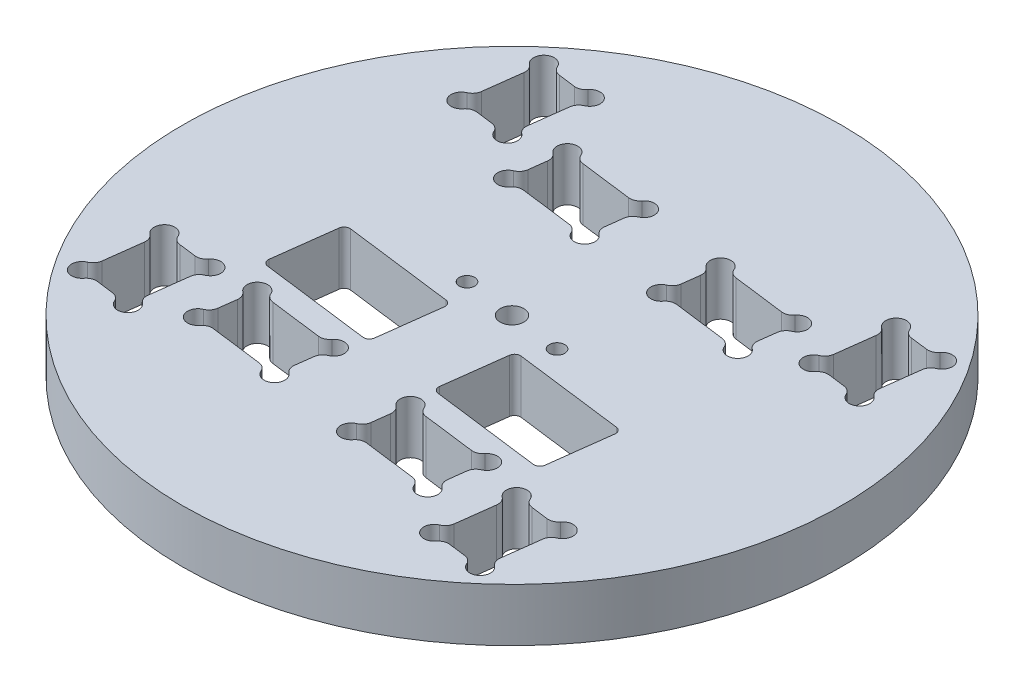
from build123d import *

# Parameters (mm, degrees)
SKETCH1_R               = 111.731821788
BOSS_EXTRUDE1_DEPTH     = 18
CUT_EXTRUDE1_DEPTH      = 160.034587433
CUT_EXTRUDE2_DEPTH      = 160.034587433
CUT_EXTRUDE2_DEPTH_BACK = 160.034587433
SKETCH4_R               = 3.5
FILLET1_R               = 3.5
CUT_EXTRUDE3_DEPTH      = 160.034587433
CUT_EXTRUDE3_DEPTH_BACK = 160.034587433
SKETCH5_R               = 4
SKETCH5_R_2             = 2.6
CUT_EXTRUDE4_DEPTH      = 160.034587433
CUT_EXTRUDE4_DEPTH_BACK = 160.034587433
FILLET2_R               = 2


with BuildPart() as part:
    # Sketch1 → Boss-Extrude1 (new body)
    with BuildSketch(Plane(origin=(0, 0, 0), x_dir=(1, 0, 0), z_dir=(0, 1, 0))):
        with Locations(Location((0, 0, 0), (0, 0, 270))):
            Circle(SKETCH1_R)
    extrude(amount=BOSS_EXTRUDE1_DEPTH)

    # Sketch3 → Cut-Extrude1 (cut, through all)
    with BuildSketch(Plane(origin=(0, 0, 0), x_dir=(-1, 0, 0), z_dir=(0, -1, 0))):
        Polygon((68.5117202, 79.310429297), (71.676307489, 54.511530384), (53.821100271, 52.233027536), (50.656512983, 77.031926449), align=None)
        Polygon((38.551654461, 57.341258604), (40.830157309, 39.486051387), (11.071478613, 35.688546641), (8.792975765, 53.543753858), align=None)
        Polygon((65.213614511, -37.04300855), (68.378201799, -61.841907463), (86.233409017, -59.563404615), (83.068821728, -34.764505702), align=None)
        Polygon((50.450502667, -35.902601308), (52.729005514, -53.757808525), (22.970326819, -57.555313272), (20.691823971, -39.700106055), align=None)
        Polygon((-20.96570293, 49.746249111), (-18.687200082, 31.891041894), (-48.445878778, 28.093537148), (-50.724381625, 45.948744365), align=None)
        Polygon((-9.066854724, -43.497610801), (-6.788351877, -61.352818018), (-36.547030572, -65.150322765), (-38.82553342, -47.295115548), align=None)
        Polygon((-53.821100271, -52.233027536), (-50.656512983, -77.031926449), (-68.5117202, -79.310429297), (-71.676307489, -54.511530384), align=None)
        Polygon((-68.378201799, 61.841907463), (-65.213614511, 37.04300855), (-83.068821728, 34.764505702), (-86.233409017, 59.563404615), align=None)
    extrude(amount=-CUT_EXTRUDE1_DEPTH, mode=Mode.SUBTRACT)

    # Sketch4 → Cut-Extrude2 (cut, two sides: drawn at the far end of the back side and taken through both)
    with BuildSketch(Plane(origin=(0, 18, 0), x_dir=(1, 0, 0), z_dir=(0, 1, 0)).offset(-CUT_EXTRUDE2_DEPTH_BACK)):
        with Locations((-68.5117202, 79.310429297)):
            Circle(SKETCH4_R)
        with Locations((-50.656512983, 77.031926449)):
            Circle(SKETCH4_R)
        with Locations((-71.676307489, 54.511530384)):
            Circle(SKETCH4_R)
        with Locations((-53.821100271, 52.233027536)):
            Circle(SKETCH4_R)
        with Locations((-38.551654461, 57.341258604)):
            Circle(SKETCH4_R)
        with Locations((-8.792975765, 53.543753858)):
            Circle(SKETCH4_R)
        with Locations((-40.830157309, 39.486051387)):
            Circle(SKETCH4_R)
        with Locations((-11.071478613, 35.688546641)):
            Circle(SKETCH4_R)
        with Locations((20.96570293, 49.746249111)):
            Circle(SKETCH4_R)
        with Locations((50.724381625, 45.948744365)):
            Circle(SKETCH4_R)
        with Locations((18.687200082, 31.891041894)):
            Circle(SKETCH4_R)
        with Locations((48.445878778, 28.093537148)):
            Circle(SKETCH4_R)
        with Locations((68.378201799, 61.841907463)):
            Circle(SKETCH4_R)
        with Locations((86.233409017, 59.563404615)):
            Circle(SKETCH4_R)
        with Locations((65.213614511, 37.04300855)):
            Circle(SKETCH4_R)
        with Locations((83.068821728, 34.764505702)):
            Circle(SKETCH4_R)
        with Locations((-83.068821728, -34.764505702)):
            Circle(SKETCH4_R)
        with Locations((-65.213614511, -37.04300855)):
            Circle(SKETCH4_R)
        with Locations((-50.450502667, -35.902601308)):
            Circle(SKETCH4_R)
        with Locations((-20.691823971, -39.700106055)):
            Circle(SKETCH4_R)
        with Locations((-86.233409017, -59.563404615)):
            Circle(SKETCH4_R)
        with Locations((-68.378201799, -61.841907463)):
            Circle(SKETCH4_R)
        with Locations((-52.729005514, -53.757808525)):
            Circle(SKETCH4_R)
        with Locations((-22.970326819, -57.555313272)):
            Circle(SKETCH4_R)
        with Locations((9.066854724, -43.497610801)):
            Circle(SKETCH4_R)
        with Locations((38.82553342, -47.295115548)):
            Circle(SKETCH4_R)
        with Locations((6.788351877, -61.352818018)):
            Circle(SKETCH4_R)
        with Locations((36.547030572, -65.150322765)):
            Circle(SKETCH4_R)
        with Locations((53.821100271, -52.233027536)):
            Circle(SKETCH4_R)
        with Locations((71.676307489, -54.511530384)):
            Circle(SKETCH4_R)
        with Locations((50.656512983, -77.031926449)):
            Circle(SKETCH4_R)
        with Locations((68.5117202, -79.310429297)):
            Circle(SKETCH4_R)
    extrude(amount=CUT_EXTRUDE2_DEPTH + CUT_EXTRUDE2_DEPTH_BACK, mode=Mode.SUBTRACT)

    # Fillet1
    fillet1_edges = [part.edges().sort_by_distance(p)[0] for p in [
        (-68.95476242, 9, -75.838583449),
        (-65.039874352, 9, -78.867387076),
        (-10.628436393, 9, -39.160392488),
        (-9.236017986, 9, -50.07190801),
        (-37.358311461, 9, -39.043009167),
        (-38.994696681, 9, -53.869412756),
        (-67.935159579, 9, 58.370061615),
        (-65.656656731, 9, 40.514854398),
        (-82.761563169, 9, 60.006446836),
        (-83.511863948, 9, 38.23635155),
        (-22.527284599, 9, 54.083467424),
        (-21.134866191, 9, 43.171951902),
        (-49.257159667, 9, 54.200850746),
        (-50.893544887, 9, 39.374447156),
        (83.511863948, 9, -38.23635155),
        (85.790366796, 9, -56.091558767),
        (68.685460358, 9, -36.59996633),
        (67.935159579, 9, -58.370061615),
        (68.95476242, 9, 75.838583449),
        (71.233265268, 9, 57.983376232),
        (54.12835883, 9, 77.474968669),
        (53.378058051, 9, 55.704873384),
        (36.990072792, 9, 61.678476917),
        (38.382491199, 9, 50.766961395),
        (10.260197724, 9, 61.795860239),
        (8.623812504, 9, 46.969456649),
        (48.888920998, 9, -31.565382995),
        (50.281339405, 9, -42.476898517),
        (22.15904593, 9, -31.447999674),
        (20.52266071, 9, -46.274403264),
        (-53.378058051, 9, -55.704873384),
        (-51.099555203, 9, -73.560080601),
        (-68.204461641, 9, -54.068488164),
        (-54.12835883, 9, -77.474968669),
        (-71.233265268, 9, -57.983376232),
        (-57.292946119, 9, -52.676069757),
        (-35.079808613, 9, -56.898216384),
        (-12.264821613, 9, -53.986796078),
        (-40.387115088, 9, -42.957897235),
        (-14.543324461, 9, -36.131588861),
        (24.437548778, 9, -49.303206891),
        (47.252535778, 9, -46.391786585),
        (19.130242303, 9, -35.362887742),
        (44.97403293, 9, -28.536579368),
        (71.850047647, 9, -61.398865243),
        (82.761563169, 9, -60.006446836),
        (65.656656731, 9, -40.514854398),
        (79.59697588, 9, -35.207547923),
        (-79.59697588, 9, 35.207547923),
        (-68.685460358, 9, 36.59996633),
        (-46.978656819, 9, 36.345643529),
        (-24.163669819, 9, 39.257063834),
        (-85.790366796, 9, 56.091558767),
        (-71.850047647, 9, 61.398865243),
        (-52.285963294, 9, 50.285962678),
        (-26.442172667, 9, 57.112271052),
        (12.538700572, 9, 43.940653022),
        (35.353687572, 9, 46.852073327),
        (7.231394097, 9, 57.880972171),
        (33.075184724, 9, 64.707280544),
        (57.292946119, 9, 52.676069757),
        (68.204461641, 9, 54.068488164),
        (51.099555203, 9, 73.560080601),
        (65.039874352, 9, 78.867387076),
    ]]
    fillet(fillet1_edges, radius=FILLET1_R)

    # Sketch5 → Cut-Extrude3 (cut, two sides: drawn at the far end of the back side and taken through both)
    with BuildSketch(Plane(origin=(0, 18, 0), x_dir=(1, 0, 0), z_dir=(0, 1, 0)).offset(-CUT_EXTRUDE3_DEPTH_BACK)):
        with Locations(Location((0, 0, 0), (0, 0, 270))):
            Circle(SKETCH5_R)
        with Locations(Location((17.5, -2.233174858, 0), (0, 0, 270))):
            Circle(SKETCH5_R_2)
        with Locations(Location((-17.5, 2.233174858, 0), (0, 0, 270))):
            Circle(SKETCH5_R_2)
    extrude(amount=CUT_EXTRUDE3_DEPTH + CUT_EXTRUDE3_DEPTH_BACK, mode=Mode.SUBTRACT)

    # Sketch7 → Cut-Extrude4 (cut, two sides: drawn at the far end of the back side and taken through both)
    with BuildSketch(Plane(origin=(0, 18, 0), x_dir=(1, 0, 0), z_dir=(0, 1, 0)).offset(-CUT_EXTRUDE4_DEPTH_BACK)):
        Polygon((11.530946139, -10.1642101), (8.340696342, -35.1642101), (49.340696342, -40.396219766), (52.530946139, -15.396219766), align=None)
        Polygon((-13.713959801, -6.942707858), (-16.904209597, -31.942707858), (-57.904209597, -26.710698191), (-54.713959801, -1.710698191), align=None)
    extrude(amount=CUT_EXTRUDE4_DEPTH + CUT_EXTRUDE4_DEPTH_BACK, mode=Mode.SUBTRACT)

    # Fillet2
    fillet2_edges = [part.edges().sort_by_distance(p)[0] for p in [
        (11.530946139, 9, 10.1642101),
        (52.530946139, 9, 15.396219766),
        (49.340696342, 9, 40.396219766),
        (8.340696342, 9, 35.1642101),
        (-54.713959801, 9, 1.710698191),
        (-13.713959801, 9, 6.942707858),
        (-16.904209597, 9, 31.942707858),
        (-57.904209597, 9, 26.710698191),
    ]]
    fillet(fillet2_edges, radius=FILLET2_R)


solid = part.part
